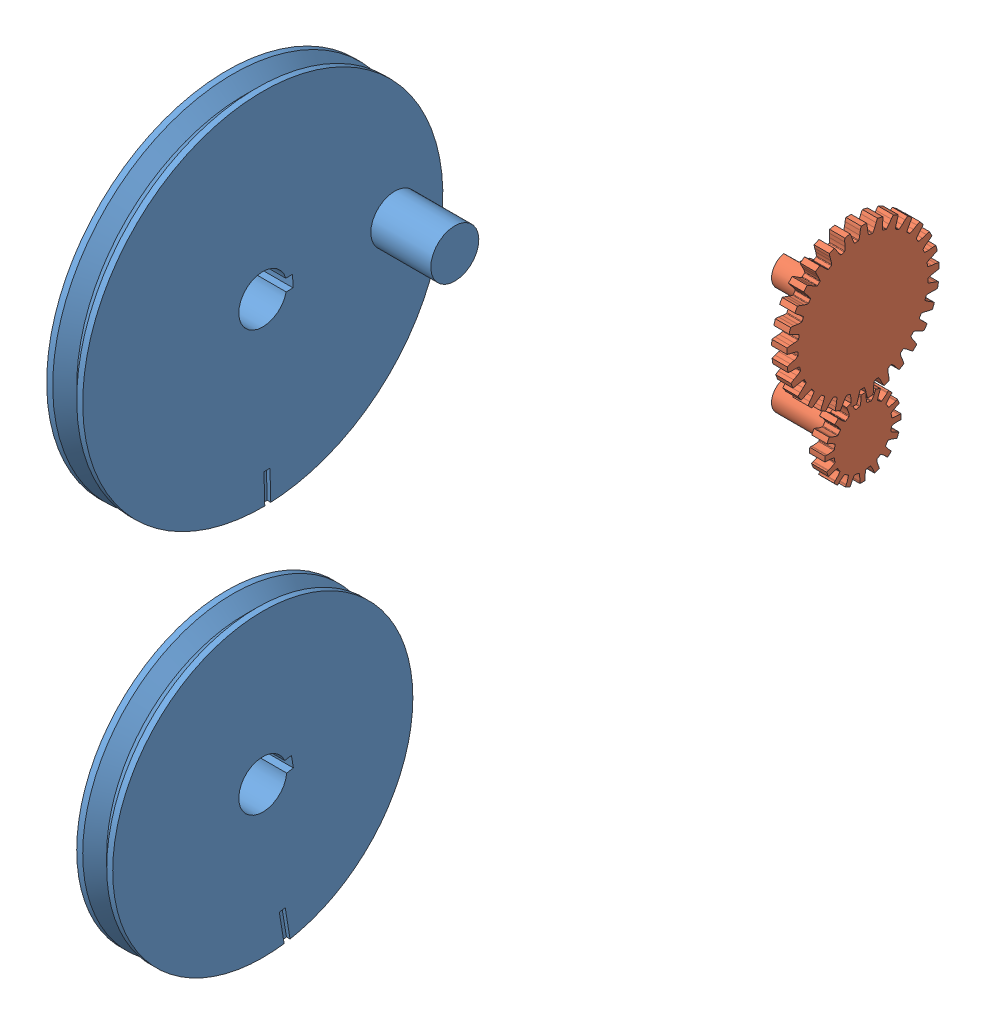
SolidWorks assembly BeltAssy.SLDASM, configuration Default (file format 3400). Lengths in mm.
Overall size (113.5 647.71 743.81).
4 component instances, 2 part files, 10 mates.
Components (placement in the parent):
- pulley-1: pulley.SLDPRT [LARGE] at (-15 350 0) x (0 0.999615 0.027753) z (0 0.027753 -0.999615) size (300 80 300)
- pulley-2: pulley.SLDPRT [SMALL] at (-15 0 0) x (0 0.986775 0.162095) z (0 0.162095 -0.986775) size (250 30 250)
- Gear-1: Gear.SLDPRT [Half Size] at (-12.7 0 -500) x (0 -0.569146 -0.822236) z (1 0 0) size (62.97 62.97 63.5)
- Gear-2: Gear.SLDPRT [Default] at (-12.7 90 -500) x (0 -0.701432 -0.712737) z (1 0 0) size (126.97 126.86 63.5)
Mates (geometry in assembly coordinates):
- Concentric3: concentric aligned: cylinder of ?; line of assembly
- Concentric2: concentric aligned: cylinder of ?; line of assembly
- Coincident8: coincident aligned: plane of assembly; plane of ?
- Coincident10: coincident aligned: plane of assembly; plane of ?
- Coincident11: coincident aligned: plane of ?; plane of assembly
- Coincident12: coincident aligned: unknown of Gear-2
- Coincident13: coincident: axis of ?; plane of assembly
- Distance1: distance = 500 mm: axis of ?; plane of assembly
- Distance2: distance = 90 mm: unknown of Gear-2
- Distance3: distance = 500 mm: unknown of Gear-2
